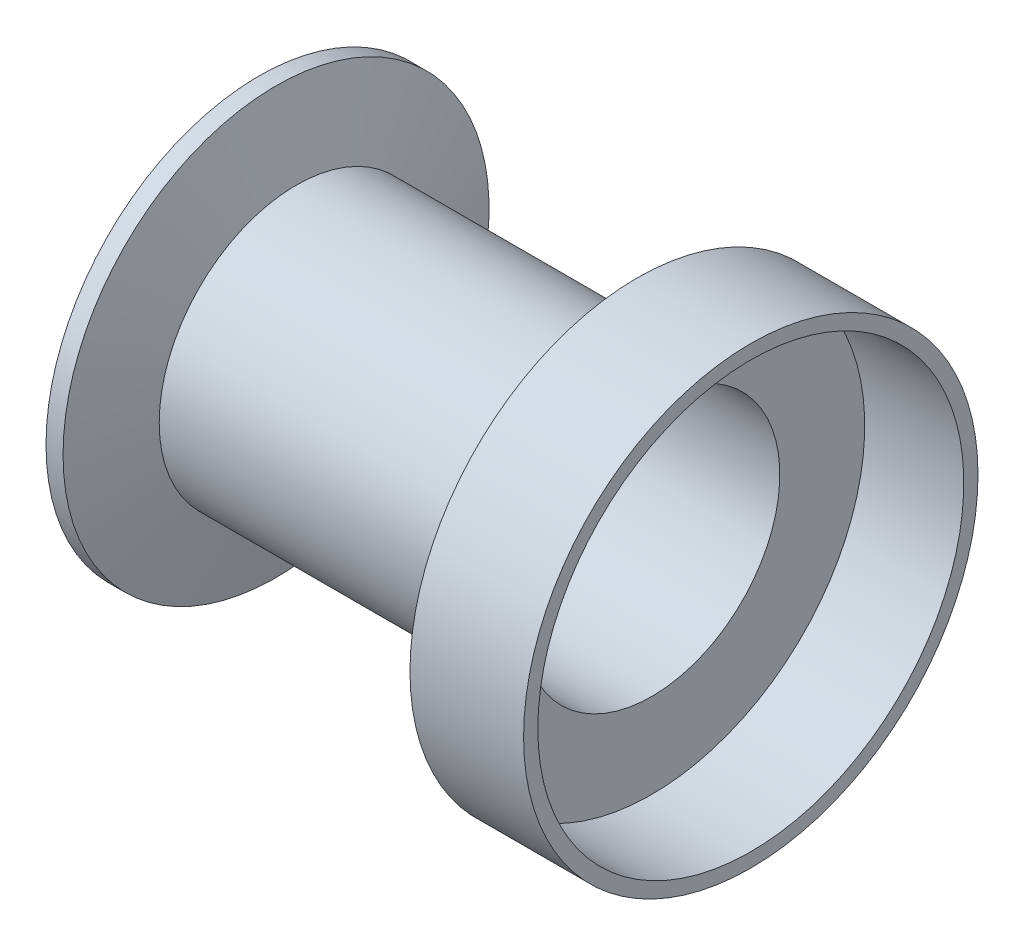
from build123d import *


with BuildPart() as part:
    # Esquisse2 → R_volution1 (revolve)
    with BuildSketch(Plane.XY, mode=Mode.PRIVATE) as r_volution1_sk:
        Polygon((0, 26.15), (0, 37.5), (3, 37.5), (6.58, 24.15), (66.58, 24.15), (66.58, 40), (86.58, 40), (86.58, 37.5), (69.14, 37.5), (69.14, 22.55), (2.5, 22.55), (2.5, 26.15), align=None)
    revolve(r_volution1_sk.sketch.rotate(Axis((0, 0, 0), (1, 0, 0)), 90), axis=Axis((0, 0, 0), (1, 0, 0)))


solid = part.part
